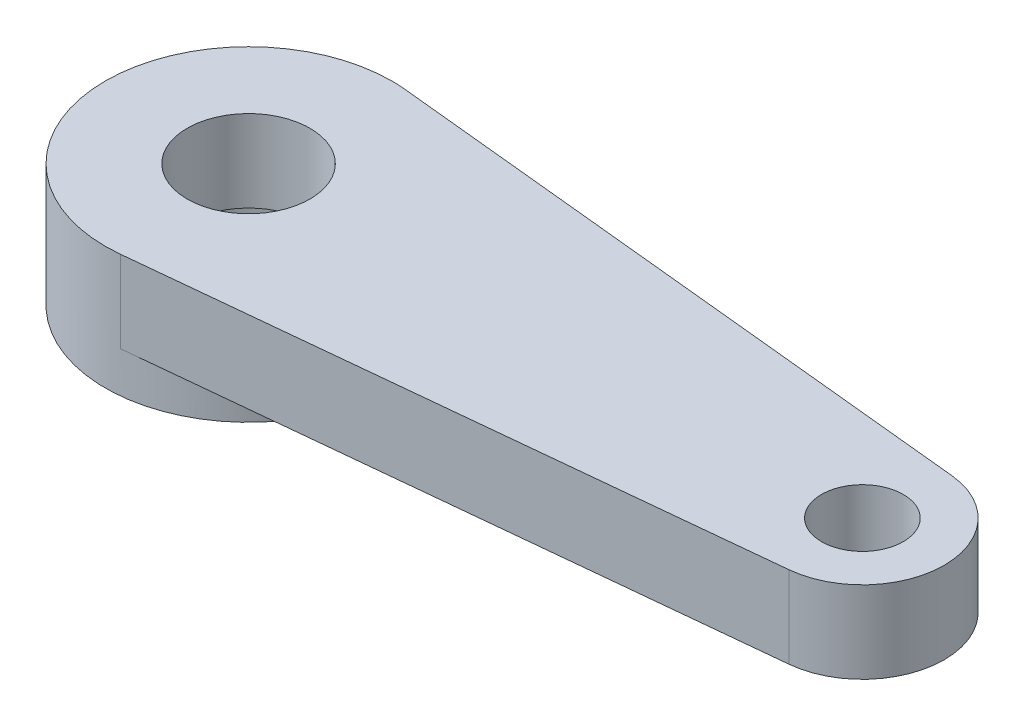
ISO-10303-21;
HEADER;
FILE_DESCRIPTION(('STEP AP214'),'2;1');
FILE_NAME('part.step','',(''),(''),'','','');
FILE_SCHEMA(('AUTOMOTIVE_DESIGN { 1 0 10303 214 1 1 1 1 }'));
ENDSEC;
DATA;
#1=APPLICATION_CONTEXT('core data for automotive mechanical design processes');
#2=APPLICATION_PROTOCOL_DEFINITION('international standard','automotive_design',2000,#1);
#3=PRODUCT_CONTEXT('',#1,'mechanical');
#4=PRODUCT('Part','Part','',(#3));
#5=PRODUCT_RELATED_PRODUCT_CATEGORY('part','',(#4));
#6=PRODUCT_DEFINITION_FORMATION('','',#4);
#7=PRODUCT_DEFINITION_CONTEXT('part definition',#1,'design');
#8=PRODUCT_DEFINITION('design','',#6,#7);
#9=PRODUCT_DEFINITION_SHAPE('','',#8);
#10=(LENGTH_UNIT() NAMED_UNIT(*) SI_UNIT(.MILLI.,.METRE.));
#11=(NAMED_UNIT(*) PLANE_ANGLE_UNIT() SI_UNIT($,.RADIAN.));
#12=(NAMED_UNIT(*) SI_UNIT($,.STERADIAN.) SOLID_ANGLE_UNIT());
#13=UNCERTAINTY_MEASURE_WITH_UNIT(LENGTH_MEASURE(1.E-05),#10,'distance_accuracy_value','');
#14=(GEOMETRIC_REPRESENTATION_CONTEXT(3) GLOBAL_UNCERTAINTY_ASSIGNED_CONTEXT((#13)) GLOBAL_UNIT_ASSIGNED_CONTEXT((#10,
#11,#12)) REPRESENTATION_CONTEXT('',''));
#15=CARTESIAN_POINT('',(0.,0.,0.));
#16=DIRECTION('',(0.,0.,1.));
#17=DIRECTION('',(1.,0.,0.));
#18=AXIS2_PLACEMENT_3D('',#15,#16,#17);
#19=CARTESIAN_POINT('',(0.,0.,0.));
#20=DIRECTION('',(0.,1.,0.));
#21=DIRECTION('',(0.,0.,1.));
#22=AXIS2_PLACEMENT_3D('',#19,#20,#21);
#23=PLANE('',#22);
#24=CARTESIAN_POINT('',(0.,0.,0.));
#25=DIRECTION('',(0.,1.,0.));
#26=DIRECTION('',(0.,0.,1.));
#27=AXIS2_PLACEMENT_3D('',#24,#25,#26);
#28=CIRCLE('',#27,1.5);
#29=CARTESIAN_POINT('',(0.,0.,1.5));
#30=VERTEX_POINT('',#29);
#31=EDGE_CURVE('E103',#30,#30,#28,.T.);
#32=ORIENTED_EDGE('',*,*,#31,.T.);
#33=EDGE_LOOP('',(#32));
#34=FACE_BOUND('',#33,.T.);
#35=CARTESIAN_POINT('',(0.,0.,0.));
#36=DIRECTION('',(0.,-1.,0.));
#37=DIRECTION('',(0.,0.,-1.));
#38=AXIS2_PLACEMENT_3D('',#35,#36,#37);
#39=CIRCLE('',#38,2.5);
#40=CARTESIAN_POINT('',(0.,0.,-2.5));
#41=VERTEX_POINT('',#40);
#42=EDGE_CURVE('E178',#41,#41,#39,.T.);
#43=ORIENTED_EDGE('',*,*,#42,.T.);
#44=EDGE_LOOP('',(#43));
#45=FACE_BOUND('',#44,.T.);
#46=ADVANCED_FACE('F37',(#34,#45),#23,.F.);
#47=CARTESIAN_POINT('',(0.350000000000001,2.,3.48245602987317));
#48=DIRECTION('',(-0.1,0.,-0.99498743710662));
#49=DIRECTION('',(-0.99498743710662,0.,0.1));
#50=AXIS2_PLACEMENT_3D('',#47,#48,#49);
#51=PLANE('',#50);
#52=DIRECTION('',(0.99498743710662,0.,-0.1));
#53=VECTOR('',#52,1.);
#54=CARTESIAN_POINT('',(0.350000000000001,0.,3.48245602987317));
#55=LINE('',#54,#53);
#56=CARTESIAN_POINT('',(0.35,0.,3.48245602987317));
#57=VERTEX_POINT('',#56);
#58=CARTESIAN_POINT('',(15.2,0.,1.98997487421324));
#59=VERTEX_POINT('',#58);
#60=EDGE_CURVE('E93',#57,#59,#55,.T.);
#61=ORIENTED_EDGE('',*,*,#60,.T.);
#62=DIRECTION('',(0.,-1.,0.));
#63=VECTOR('',#62,1.);
#64=CARTESIAN_POINT('',(15.2,2.,1.98997487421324));
#65=LINE('',#64,#63);
#66=CARTESIAN_POINT('',(15.2,2.,1.98997487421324));
#67=VERTEX_POINT('',#66);
#68=EDGE_CURVE('E11',#67,#59,#65,.T.);
#69=ORIENTED_EDGE('',*,*,#68,.F.);
#70=DIRECTION('',(0.99498743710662,0.,-0.1));
#71=VECTOR('',#70,1.);
#72=CARTESIAN_POINT('',(0.350000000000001,2.,3.48245602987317));
#73=LINE('',#72,#71);
#74=CARTESIAN_POINT('',(0.35,2.,3.48245602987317));
#75=VERTEX_POINT('',#74);
#76=EDGE_CURVE('E124',#75,#67,#73,.T.);
#77=ORIENTED_EDGE('',*,*,#76,.F.);
#78=DIRECTION('',(0.,-1.,0.));
#79=VECTOR('',#78,1.);
#80=CARTESIAN_POINT('',(0.35,2.,3.48245602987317));
#81=LINE('',#80,#79);
#82=EDGE_CURVE('E100',#75,#57,#81,.T.);
#83=ORIENTED_EDGE('',*,*,#82,.T.);
#84=EDGE_LOOP('',(#61,#69,#77,#83));
#85=FACE_BOUND('',#84,.T.);
#86=ADVANCED_FACE('F39',(#85),#51,.F.);
#87=CARTESIAN_POINT('',(15.,2.,0.));
#88=DIRECTION('',(0.,-1.,0.));
#89=DIRECTION('',(0.,0.,-1.));
#90=AXIS2_PLACEMENT_3D('',#87,#88,#89);
#91=CYLINDRICAL_SURFACE('',#90,2.);
#92=CARTESIAN_POINT('',(15.,0.,0.));
#93=DIRECTION('',(0.,1.,0.));
#94=DIRECTION('',(0.,0.,1.));
#95=AXIS2_PLACEMENT_3D('',#92,#93,#94);
#96=CIRCLE('',#95,2.);
#97=CARTESIAN_POINT('',(15.2,0.,-1.98997487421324));
#98=VERTEX_POINT('',#97);
#99=EDGE_CURVE('E104',#59,#98,#96,.T.);
#100=ORIENTED_EDGE('',*,*,#99,.T.);
#101=DIRECTION('',(0.,-1.,0.));
#102=VECTOR('',#101,1.);
#103=CARTESIAN_POINT('',(15.2,2.,-1.98997487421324));
#104=LINE('',#103,#102);
#105=CARTESIAN_POINT('',(15.2,2.,-1.98997487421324));
#106=VERTEX_POINT('',#105);
#107=EDGE_CURVE('E47',#106,#98,#104,.T.);
#108=ORIENTED_EDGE('',*,*,#107,.F.);
#109=CARTESIAN_POINT('',(15.,2.,0.));
#110=DIRECTION('',(0.,1.,0.));
#111=DIRECTION('',(0.,0.,1.));
#112=AXIS2_PLACEMENT_3D('',#109,#110,#111);
#113=CIRCLE('',#112,2.);
#114=EDGE_CURVE('E84',#67,#106,#113,.T.);
#115=ORIENTED_EDGE('',*,*,#114,.F.);
#116=ORIENTED_EDGE('',*,*,#68,.T.);
#117=EDGE_LOOP('',(#100,#108,#115,#116));
#118=FACE_BOUND('',#117,.T.);
#119=ADVANCED_FACE('F157',(#118),#91,.T.);
#120=CARTESIAN_POINT('',(0.35,2.,-3.48245602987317));
#121=DIRECTION('',(0.1,0.,-0.99498743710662));
#122=DIRECTION('',(-0.99498743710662,0.,-0.1));
#123=AXIS2_PLACEMENT_3D('',#120,#121,#122);
#124=PLANE('',#123);
#125=DIRECTION('',(0.99498743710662,0.,0.1));
#126=VECTOR('',#125,1.);
#127=CARTESIAN_POINT('',(0.35,0.,-3.48245602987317));
#128=LINE('',#127,#126);
#129=CARTESIAN_POINT('',(0.35,0.,-3.48245602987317));
#130=VERTEX_POINT('',#129);
#131=EDGE_CURVE('E91',#130,#98,#128,.T.);
#132=ORIENTED_EDGE('',*,*,#131,.F.);
#133=DIRECTION('',(0.,-1.,0.));
#134=VECTOR('',#133,1.);
#135=CARTESIAN_POINT('',(0.35,2.,-3.48245602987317));
#136=LINE('',#135,#134);
#137=CARTESIAN_POINT('',(0.35,2.,-3.48245602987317));
#138=VERTEX_POINT('',#137);
#139=EDGE_CURVE('E97',#138,#130,#136,.T.);
#140=ORIENTED_EDGE('',*,*,#139,.F.);
#141=DIRECTION('',(0.99498743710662,0.,0.1));
#142=VECTOR('',#141,1.);
#143=CARTESIAN_POINT('',(0.35,2.,-3.48245602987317));
#144=LINE('',#143,#142);
#145=EDGE_CURVE('E127',#138,#106,#144,.T.);
#146=ORIENTED_EDGE('',*,*,#145,.T.);
#147=ORIENTED_EDGE('',*,*,#107,.T.);
#148=EDGE_LOOP('',(#132,#140,#146,#147));
#149=FACE_BOUND('',#148,.T.);
#150=ADVANCED_FACE('F102',(#149),#124,.T.);
#151=CARTESIAN_POINT('',(0.,2.,0.));
#152=DIRECTION('',(0.,-1.,0.));
#153=DIRECTION('',(0.,0.,-1.));
#154=AXIS2_PLACEMENT_3D('',#151,#152,#153);
#155=CYLINDRICAL_SURFACE('',#154,1.5);
#156=CARTESIAN_POINT('',(0.,2.,0.));
#157=DIRECTION('',(0.,1.,0.));
#158=DIRECTION('',(0.,0.,1.));
#159=AXIS2_PLACEMENT_3D('',#156,#157,#158);
#160=CIRCLE('',#159,1.5);
#161=CARTESIAN_POINT('',(0.,2.,1.5));
#162=VERTEX_POINT('',#161);
#163=EDGE_CURVE('E130',#162,#162,#160,.T.);
#164=ORIENTED_EDGE('',*,*,#163,.T.);
#165=EDGE_LOOP('',(#164));
#166=FACE_BOUND('',#165,.T.);
#167=ORIENTED_EDGE('',*,*,#31,.F.);
#168=EDGE_LOOP('',(#167));
#169=FACE_BOUND('',#168,.T.);
#170=ADVANCED_FACE('F148',(#166,#169),#155,.F.);
#171=CARTESIAN_POINT('',(0.,2.,0.));
#172=DIRECTION('',(0.,-1.,0.));
#173=DIRECTION('',(0.,0.,-1.));
#174=AXIS2_PLACEMENT_3D('',#171,#172,#173);
#175=CYLINDRICAL_SURFACE('',#174,3.5);
#176=ORIENTED_EDGE('',*,*,#139,.T.);
#177=CARTESIAN_POINT('',(0.,0.,0.));
#178=DIRECTION('',(0.,-1.,0.));
#179=DIRECTION('',(0.,0.,-1.));
#180=AXIS2_PLACEMENT_3D('',#177,#178,#179);
#181=CIRCLE('',#180,3.5);
#182=EDGE_CURVE('E78',#130,#57,#181,.T.);
#183=ORIENTED_EDGE('',*,*,#182,.T.);
#184=ORIENTED_EDGE('',*,*,#82,.F.);
#185=CARTESIAN_POINT('',(0.,2.,0.));
#186=DIRECTION('',(0.,1.,0.));
#187=DIRECTION('',(0.,0.,1.));
#188=AXIS2_PLACEMENT_3D('',#185,#186,#187);
#189=CIRCLE('',#188,3.5);
#190=EDGE_CURVE('E56',#138,#75,#189,.T.);
#191=ORIENTED_EDGE('',*,*,#190,.F.);
#192=EDGE_LOOP('',(#176,#183,#184,#191));
#193=FACE_BOUND('',#192,.T.);
#194=CARTESIAN_POINT('',(0.,-1.,0.));
#195=DIRECTION('',(0.,-1.,0.));
#196=DIRECTION('',(0.,0.,-1.));
#197=AXIS2_PLACEMENT_3D('',#194,#195,#196);
#198=CIRCLE('',#197,3.5);
#199=CARTESIAN_POINT('',(0.,-1.,-3.5));
#200=VERTEX_POINT('',#199);
#201=EDGE_CURVE('E94',#200,#200,#198,.T.);
#202=ORIENTED_EDGE('',*,*,#201,.F.);
#203=EDGE_LOOP('',(#202));
#204=FACE_BOUND('',#203,.T.);
#205=ADVANCED_FACE('F98',(#193,#204),#175,.T.);
#206=CARTESIAN_POINT('',(15.,2.,0.));
#207=DIRECTION('',(0.,-1.,0.));
#208=DIRECTION('',(0.,0.,-1.));
#209=AXIS2_PLACEMENT_3D('',#206,#207,#208);
#210=CYLINDRICAL_SURFACE('',#209,1.);
#211=CARTESIAN_POINT('',(15.,2.,0.));
#212=DIRECTION('',(0.,1.,0.));
#213=DIRECTION('',(0.,0.,1.));
#214=AXIS2_PLACEMENT_3D('',#211,#212,#213);
#215=CIRCLE('',#214,1.);
#216=CARTESIAN_POINT('',(15.,2.,1.));
#217=VERTEX_POINT('',#216);
#218=EDGE_CURVE('E118',#217,#217,#215,.T.);
#219=ORIENTED_EDGE('',*,*,#218,.T.);
#220=EDGE_LOOP('',(#219));
#221=FACE_BOUND('',#220,.T.);
#222=CARTESIAN_POINT('',(15.,0.,0.));
#223=DIRECTION('',(0.,1.,0.));
#224=DIRECTION('',(0.,0.,1.));
#225=AXIS2_PLACEMENT_3D('',#222,#223,#224);
#226=CIRCLE('',#225,1.);
#227=CARTESIAN_POINT('',(15.,0.,1.));
#228=VERTEX_POINT('',#227);
#229=EDGE_CURVE('E106',#228,#228,#226,.T.);
#230=ORIENTED_EDGE('',*,*,#229,.F.);
#231=EDGE_LOOP('',(#230));
#232=FACE_BOUND('',#231,.T.);
#233=ADVANCED_FACE('F138',(#221,#232),#210,.F.);
#234=CARTESIAN_POINT('',(0.,2.,0.));
#235=DIRECTION('',(0.,1.,0.));
#236=DIRECTION('',(0.,0.,1.));
#237=AXIS2_PLACEMENT_3D('',#234,#235,#236);
#238=PLANE('',#237);
#239=ORIENTED_EDGE('',*,*,#76,.T.);
#240=ORIENTED_EDGE('',*,*,#114,.T.);
#241=ORIENTED_EDGE('',*,*,#145,.F.);
#242=ORIENTED_EDGE('',*,*,#190,.T.);
#243=EDGE_LOOP('',(#239,#240,#241,#242));
#244=FACE_BOUND('',#243,.T.);
#245=ORIENTED_EDGE('',*,*,#163,.F.);
#246=EDGE_LOOP('',(#245));
#247=FACE_BOUND('',#246,.T.);
#248=ORIENTED_EDGE('',*,*,#218,.F.);
#249=EDGE_LOOP('',(#248));
#250=FACE_BOUND('',#249,.T.);
#251=ADVANCED_FACE('F140',(#244,#247,#250),#238,.T.);
#252=ORIENTED_EDGE('',*,*,#182,.F.);
#253=ORIENTED_EDGE('',*,*,#131,.T.);
#254=ORIENTED_EDGE('',*,*,#99,.F.);
#255=ORIENTED_EDGE('',*,*,#60,.F.);
#256=EDGE_LOOP('',(#252,#253,#254,#255));
#257=FACE_BOUND('',#256,.T.);
#258=ORIENTED_EDGE('',*,*,#229,.T.);
#259=EDGE_LOOP('',(#258));
#260=FACE_BOUND('',#259,.T.);
#261=ADVANCED_FACE('F89',(#257,#260),#23,.F.);
#262=CARTESIAN_POINT('',(0.,-1.,0.));
#263=DIRECTION('',(0.,-1.,0.));
#264=DIRECTION('',(0.,0.,-1.));
#265=AXIS2_PLACEMENT_3D('',#262,#263,#264);
#266=PLANE('',#265);
#267=ORIENTED_EDGE('',*,*,#201,.T.);
#268=EDGE_LOOP('',(#267));
#269=FACE_BOUND('',#268,.T.);
#270=CARTESIAN_POINT('',(0.,-1.,0.));
#271=DIRECTION('',(0.,-1.,0.));
#272=DIRECTION('',(0.,0.,-1.));
#273=AXIS2_PLACEMENT_3D('',#270,#271,#272);
#274=CIRCLE('',#273,2.5);
#275=CARTESIAN_POINT('',(0.,-1.,-2.5));
#276=VERTEX_POINT('',#275);
#277=EDGE_CURVE('E95',#276,#276,#274,.T.);
#278=ORIENTED_EDGE('',*,*,#277,.F.);
#279=EDGE_LOOP('',(#278));
#280=FACE_BOUND('',#279,.T.);
#281=ADVANCED_FACE('F161',(#269,#280),#266,.T.);
#282=CARTESIAN_POINT('',(0.,-1.,0.));
#283=DIRECTION('',(0.,1.,0.));
#284=DIRECTION('',(0.,0.,1.));
#285=AXIS2_PLACEMENT_3D('',#282,#283,#284);
#286=CYLINDRICAL_SURFACE('',#285,2.5);
#287=ORIENTED_EDGE('',*,*,#277,.T.);
#288=EDGE_LOOP('',(#287));
#289=FACE_BOUND('',#288,.T.);
#290=ORIENTED_EDGE('',*,*,#42,.F.);
#291=EDGE_LOOP('',(#290));
#292=FACE_BOUND('',#291,.T.);
#293=ADVANCED_FACE('F165',(#289,#292),#286,.F.);
#294=CLOSED_SHELL('',(#46,#86,#119,#150,#170,#205,#233,#251,#261,#281,#293));
#295=MANIFOLD_SOLID_BREP('B2',#294);
#296=ADVANCED_BREP_SHAPE_REPRESENTATION('',(#18,#295),#14);
#297=SHAPE_DEFINITION_REPRESENTATION(#9,#296);
ENDSEC;
END-ISO-10303-21;
